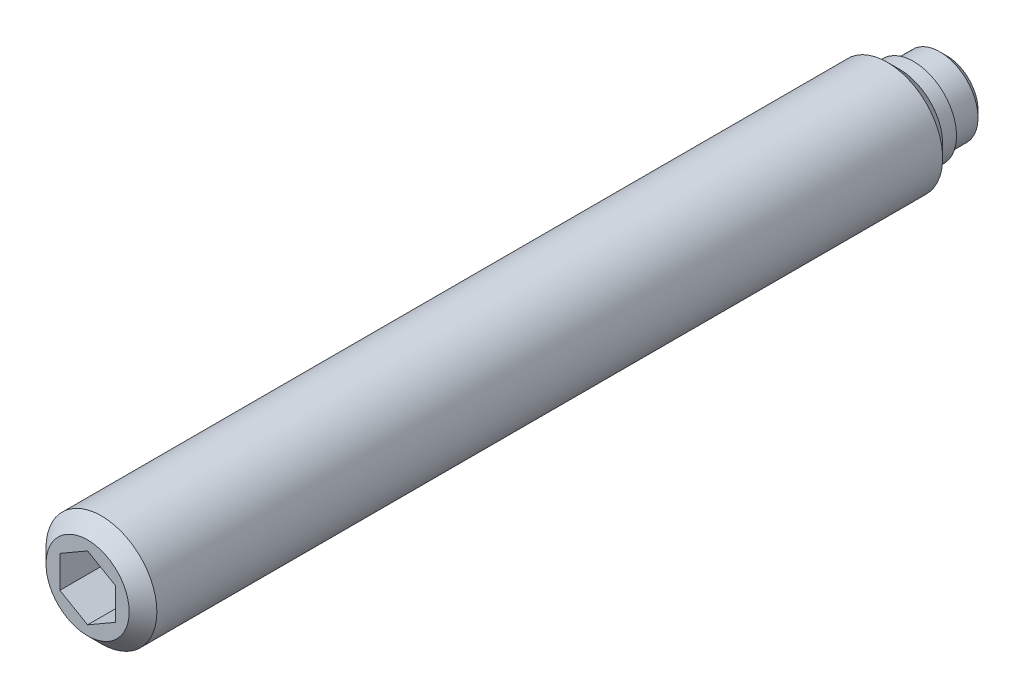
ISO-10303-21;
HEADER;
FILE_DESCRIPTION(('STEP AP214'),'2;1');
FILE_NAME('part.step','',(''),(''),'','','');
FILE_SCHEMA(('AUTOMOTIVE_DESIGN { 1 0 10303 214 1 1 1 1 }'));
ENDSEC;
DATA;
#1=APPLICATION_CONTEXT('core data for automotive mechanical design processes');
#2=APPLICATION_PROTOCOL_DEFINITION('international standard','automotive_design',2000,#1);
#3=PRODUCT_CONTEXT('',#1,'mechanical');
#4=PRODUCT('Part','Part','',(#3));
#5=PRODUCT_RELATED_PRODUCT_CATEGORY('part','',(#4));
#6=PRODUCT_DEFINITION_FORMATION('','',#4);
#7=PRODUCT_DEFINITION_CONTEXT('part definition',#1,'design');
#8=PRODUCT_DEFINITION('design','',#6,#7);
#9=PRODUCT_DEFINITION_SHAPE('','',#8);
#10=(LENGTH_UNIT() NAMED_UNIT(*) SI_UNIT(.MILLI.,.METRE.));
#11=(NAMED_UNIT(*) PLANE_ANGLE_UNIT() SI_UNIT($,.RADIAN.));
#12=(NAMED_UNIT(*) SI_UNIT($,.STERADIAN.) SOLID_ANGLE_UNIT());
#13=UNCERTAINTY_MEASURE_WITH_UNIT(LENGTH_MEASURE(1.E-05),#10,'distance_accuracy_value','');
#14=(GEOMETRIC_REPRESENTATION_CONTEXT(3) GLOBAL_UNCERTAINTY_ASSIGNED_CONTEXT((#13)) GLOBAL_UNIT_ASSIGNED_CONTEXT((#10,
#11,#12)) REPRESENTATION_CONTEXT('',''));
#15=CARTESIAN_POINT('',(0.,0.,0.));
#16=DIRECTION('',(0.,0.,1.));
#17=DIRECTION('',(1.,0.,0.));
#18=AXIS2_PLACEMENT_3D('',#15,#16,#17);
#19=CARTESIAN_POINT('',(0.,0.,2.4));
#20=DIRECTION('',(0.,0.,-1.));
#21=DIRECTION('',(-1.,0.,0.));
#22=AXIS2_PLACEMENT_3D('',#19,#20,#21);
#23=CYLINDRICAL_SURFACE('',#22,4.);
#24=CARTESIAN_POINT('',(0.,0.,4.3));
#25=DIRECTION('',(0.,0.,-1.));
#26=DIRECTION('',(-1.,0.,0.));
#27=AXIS2_PLACEMENT_3D('',#24,#25,#26);
#28=CIRCLE('',#27,4.);
#29=CARTESIAN_POINT('',(-4.,0.,4.3));
#30=VERTEX_POINT('',#29);
#31=EDGE_CURVE('E9',#30,#30,#28,.T.);
#32=ORIENTED_EDGE('',*,*,#31,.F.);
#33=EDGE_LOOP('',(#32));
#34=FACE_BOUND('',#33,.T.);
#35=CARTESIAN_POINT('',(0.,0.,61.));
#36=DIRECTION('',(0.,0.,1.));
#37=DIRECTION('',(1.,0.,0.));
#38=AXIS2_PLACEMENT_3D('',#35,#36,#37);
#39=CIRCLE('',#38,4.);
#40=CARTESIAN_POINT('',(4.,0.,61.));
#41=VERTEX_POINT('',#40);
#42=EDGE_CURVE('E70',#41,#41,#39,.T.);
#43=ORIENTED_EDGE('',*,*,#42,.F.);
#44=EDGE_LOOP('',(#43));
#45=FACE_BOUND('',#44,.T.);
#46=ADVANCED_FACE('F14',(#34,#45),#23,.T.);
#47=CARTESIAN_POINT('',(0.,0.,4.3));
#48=DIRECTION('',(0.,0.,1.));
#49=DIRECTION('',(1.,0.,0.));
#50=AXIS2_PLACEMENT_3D('',#47,#48,#49);
#51=CONICAL_SURFACE('',#50,4.,0.785398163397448);
#52=ORIENTED_EDGE('',*,*,#31,.T.);
#53=EDGE_LOOP('',(#52));
#54=FACE_BOUND('',#53,.T.);
#55=CARTESIAN_POINT('',(0.,0.,3.4));
#56=DIRECTION('',(0.,0.,-1.));
#57=DIRECTION('',(-1.,0.,0.));
#58=AXIS2_PLACEMENT_3D('',#55,#56,#57);
#59=CIRCLE('',#58,3.1);
#60=CARTESIAN_POINT('',(-3.1,0.,3.4));
#61=VERTEX_POINT('',#60);
#62=EDGE_CURVE('E21',#61,#61,#59,.T.);
#63=ORIENTED_EDGE('',*,*,#62,.F.);
#64=EDGE_LOOP('',(#63));
#65=FACE_BOUND('',#64,.T.);
#66=ADVANCED_FACE('F139',(#54,#65),#51,.T.);
#67=CARTESIAN_POINT('',(0.,0.,2.4));
#68=DIRECTION('',(0.,0.,-1.));
#69=DIRECTION('',(-1.,0.,0.));
#70=AXIS2_PLACEMENT_3D('',#67,#68,#69);
#71=CYLINDRICAL_SURFACE('',#70,3.1);
#72=ORIENTED_EDGE('',*,*,#62,.T.);
#73=EDGE_LOOP('',(#72));
#74=FACE_BOUND('',#73,.T.);
#75=CARTESIAN_POINT('',(0.,0.,2.4));
#76=DIRECTION('',(0.,0.,-1.));
#77=DIRECTION('',(-1.,0.,0.));
#78=AXIS2_PLACEMENT_3D('',#75,#76,#77);
#79=CIRCLE('',#78,3.1);
#80=CARTESIAN_POINT('',(-3.1,0.,2.4));
#81=VERTEX_POINT('',#80);
#82=EDGE_CURVE('E131',#81,#81,#79,.T.);
#83=ORIENTED_EDGE('',*,*,#82,.F.);
#84=EDGE_LOOP('',(#83));
#85=FACE_BOUND('',#84,.T.);
#86=ADVANCED_FACE('F136',(#74,#85),#71,.T.);
#87=CARTESIAN_POINT('',(0.,3.1,2.4));
#88=DIRECTION('',(0.,0.,1.));
#89=DIRECTION('',(1.,0.,0.));
#90=AXIS2_PLACEMENT_3D('',#87,#88,#89);
#91=PLANE('',#90);
#92=ORIENTED_EDGE('',*,*,#82,.T.);
#93=EDGE_LOOP('',(#92));
#94=FACE_BOUND('',#93,.T.);
#95=CARTESIAN_POINT('',(0.,0.,2.4));
#96=DIRECTION('',(0.,0.,-1.));
#97=DIRECTION('',(-1.,0.,0.));
#98=AXIS2_PLACEMENT_3D('',#95,#96,#97);
#99=CIRCLE('',#98,2.75);
#100=CARTESIAN_POINT('',(-2.75,0.,2.4));
#101=VERTEX_POINT('',#100);
#102=EDGE_CURVE('E128',#101,#101,#99,.T.);
#103=ORIENTED_EDGE('',*,*,#102,.F.);
#104=EDGE_LOOP('',(#103));
#105=FACE_BOUND('',#104,.T.);
#106=ADVANCED_FACE('F147',(#94,#105),#91,.F.);
#107=CARTESIAN_POINT('',(0.,0.,0.));
#108=DIRECTION('',(0.,0.,-1.));
#109=DIRECTION('',(-1.,0.,0.));
#110=AXIS2_PLACEMENT_3D('',#107,#108,#109);
#111=CYLINDRICAL_SURFACE('',#110,2.75);
#112=CARTESIAN_POINT('',(0.,0.,0.5));
#113=DIRECTION('',(0.,0.,-1.));
#114=DIRECTION('',(-1.,0.,0.));
#115=AXIS2_PLACEMENT_3D('',#112,#113,#114);
#116=CIRCLE('',#115,2.75);
#117=CARTESIAN_POINT('',(-2.75,0.,0.5));
#118=VERTEX_POINT('',#117);
#119=EDGE_CURVE('E125',#118,#118,#116,.T.);
#120=ORIENTED_EDGE('',*,*,#119,.F.);
#121=EDGE_LOOP('',(#120));
#122=FACE_BOUND('',#121,.T.);
#123=ORIENTED_EDGE('',*,*,#102,.T.);
#124=EDGE_LOOP('',(#123));
#125=FACE_BOUND('',#124,.T.);
#126=ADVANCED_FACE('F153',(#122,#125),#111,.T.);
#127=CARTESIAN_POINT('',(0.,0.,0.5));
#128=DIRECTION('',(0.,0.,1.));
#129=DIRECTION('',(1.,0.,0.));
#130=AXIS2_PLACEMENT_3D('',#127,#128,#129);
#131=CONICAL_SURFACE('',#130,2.75,0.785398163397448);
#132=CARTESIAN_POINT('',(0.,0.,0.));
#133=DIRECTION('',(0.,0.,-1.));
#134=DIRECTION('',(-1.,0.,0.));
#135=AXIS2_PLACEMENT_3D('',#132,#133,#134);
#136=CIRCLE('',#135,2.25);
#137=CARTESIAN_POINT('',(-2.25,0.,0.));
#138=VERTEX_POINT('',#137);
#139=EDGE_CURVE('E122',#138,#138,#136,.T.);
#140=ORIENTED_EDGE('',*,*,#139,.F.);
#141=EDGE_LOOP('',(#140));
#142=FACE_BOUND('',#141,.T.);
#143=ORIENTED_EDGE('',*,*,#119,.T.);
#144=EDGE_LOOP('',(#143));
#145=FACE_BOUND('',#144,.T.);
#146=ADVANCED_FACE('F157',(#142,#145),#131,.T.);
#147=CARTESIAN_POINT('',(0.,2.25,0.));
#148=DIRECTION('',(0.,0.,1.));
#149=DIRECTION('',(1.,0.,0.));
#150=AXIS2_PLACEMENT_3D('',#147,#148,#149);
#151=PLANE('',#150);
#152=ORIENTED_EDGE('',*,*,#139,.T.);
#153=EDGE_LOOP('',(#152));
#154=FACE_BOUND('',#153,.T.);
#155=ADVANCED_FACE('F161',(#154),#151,.F.);
#156=CARTESIAN_POINT('',(0.,0.,62.));
#157=DIRECTION('',(0.,0.,1.));
#158=DIRECTION('',(1.,0.,0.));
#159=AXIS2_PLACEMENT_3D('',#156,#157,#158);
#160=PLANE('',#159);
#161=DIRECTION('',(0.866025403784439,-0.5,0.));
#162=VECTOR('',#161,1.);
#163=CARTESIAN_POINT('',(-2.,-1.15470053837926,62.));
#164=LINE('',#163,#162);
#165=CARTESIAN_POINT('',(-2.,-1.15470053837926,62.));
#166=VERTEX_POINT('',#165);
#167=CARTESIAN_POINT('',(0.,-2.30940107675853,62.));
#168=VERTEX_POINT('',#167);
#169=EDGE_CURVE('E28',#166,#168,#164,.T.);
#170=ORIENTED_EDGE('',*,*,#169,.F.);
#171=DIRECTION('',(0.,-1.,0.));
#172=VECTOR('',#171,1.);
#173=CARTESIAN_POINT('',(-2.,1.15470053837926,62.));
#174=LINE('',#173,#172);
#175=CARTESIAN_POINT('',(-2.,1.15470053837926,62.));
#176=VERTEX_POINT('',#175);
#177=EDGE_CURVE('E69',#176,#166,#174,.T.);
#178=ORIENTED_EDGE('',*,*,#177,.F.);
#179=DIRECTION('',(-0.866025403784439,-0.5,0.));
#180=VECTOR('',#179,1.);
#181=CARTESIAN_POINT('',(0.,2.30940107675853,62.));
#182=LINE('',#181,#180);
#183=CARTESIAN_POINT('',(0.,2.30940107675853,62.));
#184=VERTEX_POINT('',#183);
#185=EDGE_CURVE('E105',#184,#176,#182,.T.);
#186=ORIENTED_EDGE('',*,*,#185,.F.);
#187=DIRECTION('',(-0.866025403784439,0.5,0.));
#188=VECTOR('',#187,1.);
#189=CARTESIAN_POINT('',(2.,1.15470053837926,62.));
#190=LINE('',#189,#188);
#191=CARTESIAN_POINT('',(2.,1.15470053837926,62.));
#192=VERTEX_POINT('',#191);
#193=EDGE_CURVE('E102',#192,#184,#190,.T.);
#194=ORIENTED_EDGE('',*,*,#193,.F.);
#195=DIRECTION('',(0.,1.,0.));
#196=VECTOR('',#195,1.);
#197=CARTESIAN_POINT('',(2.,-1.15470053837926,62.));
#198=LINE('',#197,#196);
#199=CARTESIAN_POINT('',(2.,-1.15470053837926,62.));
#200=VERTEX_POINT('',#199);
#201=EDGE_CURVE('E99',#200,#192,#198,.T.);
#202=ORIENTED_EDGE('',*,*,#201,.F.);
#203=DIRECTION('',(0.866025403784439,0.5,0.));
#204=VECTOR('',#203,1.);
#205=CARTESIAN_POINT('',(0.,-2.30940107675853,62.));
#206=LINE('',#205,#204);
#207=EDGE_CURVE('E96',#168,#200,#206,.T.);
#208=ORIENTED_EDGE('',*,*,#207,.F.);
#209=EDGE_LOOP('',(#170,#178,#186,#194,#202,#208));
#210=FACE_BOUND('',#209,.T.);
#211=CARTESIAN_POINT('',(0.,0.,62.));
#212=DIRECTION('',(0.,0.,1.));
#213=DIRECTION('',(1.,0.,0.));
#214=AXIS2_PLACEMENT_3D('',#211,#212,#213);
#215=CIRCLE('',#214,3.);
#216=CARTESIAN_POINT('',(3.,0.,62.));
#217=VERTEX_POINT('',#216);
#218=EDGE_CURVE('E119',#217,#217,#215,.T.);
#219=ORIENTED_EDGE('',*,*,#218,.T.);
#220=EDGE_LOOP('',(#219));
#221=FACE_BOUND('',#220,.T.);
#222=ADVANCED_FACE('F165',(#210,#221),#160,.T.);
#223=CARTESIAN_POINT('',(0.,0.,62.));
#224=DIRECTION('',(0.,0.,-1.));
#225=DIRECTION('',(-1.,0.,0.));
#226=AXIS2_PLACEMENT_3D('',#223,#224,#225);
#227=CONICAL_SURFACE('',#226,3.,0.785398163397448);
#228=ORIENTED_EDGE('',*,*,#42,.T.);
#229=EDGE_LOOP('',(#228));
#230=FACE_BOUND('',#229,.T.);
#231=ORIENTED_EDGE('',*,*,#218,.F.);
#232=EDGE_LOOP('',(#231));
#233=FACE_BOUND('',#232,.T.);
#234=ADVANCED_FACE('F169',(#230,#233),#227,.T.);
#235=CARTESIAN_POINT('',(-2.,-1.15470053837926,59.));
#236=DIRECTION('',(-0.5,-0.866025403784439,0.));
#237=DIRECTION('',(0.866025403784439,-0.5,0.));
#238=AXIS2_PLACEMENT_3D('',#235,#236,#237);
#239=PLANE('',#238);
#240=ORIENTED_EDGE('',*,*,#169,.T.);
#241=DIRECTION('',(0.,0.,1.));
#242=VECTOR('',#241,1.);
#243=CARTESIAN_POINT('',(0.,-2.30940107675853,59.));
#244=LINE('',#243,#242);
#245=CARTESIAN_POINT('',(0.,-2.30940107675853,57.));
#246=VERTEX_POINT('',#245);
#247=EDGE_CURVE('E76',#246,#168,#244,.T.);
#248=ORIENTED_EDGE('',*,*,#247,.F.);
#249=DIRECTION('',(0.866025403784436,-0.5,0.));
#250=VECTOR('',#249,1.);
#251=CARTESIAN_POINT('',(-2.,-1.15470053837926,57.));
#252=LINE('',#251,#250);
#253=CARTESIAN_POINT('',(-2.,-1.15470053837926,57.));
#254=VERTEX_POINT('',#253);
#255=EDGE_CURVE('E74',#254,#246,#252,.T.);
#256=ORIENTED_EDGE('',*,*,#255,.F.);
#257=DIRECTION('',(0.,0.,1.));
#258=VECTOR('',#257,1.);
#259=CARTESIAN_POINT('',(-2.,-1.15470053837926,59.));
#260=LINE('',#259,#258);
#261=EDGE_CURVE('E33',#254,#166,#260,.T.);
#262=ORIENTED_EDGE('',*,*,#261,.T.);
#263=EDGE_LOOP('',(#240,#248,#256,#262));
#264=FACE_BOUND('',#263,.T.);
#265=ADVANCED_FACE('F75',(#264),#239,.F.);
#266=CARTESIAN_POINT('',(-2.,1.15470053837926,59.));
#267=DIRECTION('',(-1.,0.,0.));
#268=DIRECTION('',(0.,0.,1.));
#269=AXIS2_PLACEMENT_3D('',#266,#267,#268);
#270=PLANE('',#269);
#271=ORIENTED_EDGE('',*,*,#177,.T.);
#272=ORIENTED_EDGE('',*,*,#261,.F.);
#273=DIRECTION('',(0.,-1.,0.));
#274=VECTOR('',#273,1.);
#275=CARTESIAN_POINT('',(-2.,1.15470053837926,57.));
#276=LINE('',#275,#274);
#277=CARTESIAN_POINT('',(-2.,1.15470053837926,57.));
#278=VERTEX_POINT('',#277);
#279=EDGE_CURVE('E66',#278,#254,#276,.T.);
#280=ORIENTED_EDGE('',*,*,#279,.F.);
#281=DIRECTION('',(0.,0.,1.));
#282=VECTOR('',#281,1.);
#283=CARTESIAN_POINT('',(-2.,1.15470053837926,59.));
#284=LINE('',#283,#282);
#285=EDGE_CURVE('E71',#278,#176,#284,.T.);
#286=ORIENTED_EDGE('',*,*,#285,.T.);
#287=EDGE_LOOP('',(#271,#272,#280,#286));
#288=FACE_BOUND('',#287,.T.);
#289=ADVANCED_FACE('F64',(#288),#270,.F.);
#290=CARTESIAN_POINT('',(0.,2.30940107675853,59.));
#291=DIRECTION('',(-0.5,0.866025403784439,0.));
#292=DIRECTION('',(-0.866025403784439,-0.5,0.));
#293=AXIS2_PLACEMENT_3D('',#290,#291,#292);
#294=PLANE('',#293);
#295=ORIENTED_EDGE('',*,*,#185,.T.);
#296=ORIENTED_EDGE('',*,*,#285,.F.);
#297=DIRECTION('',(-0.866025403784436,-0.5,0.));
#298=VECTOR('',#297,1.);
#299=CARTESIAN_POINT('',(0.,2.30940107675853,57.));
#300=LINE('',#299,#298);
#301=CARTESIAN_POINT('',(0.,2.30940107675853,57.));
#302=VERTEX_POINT('',#301);
#303=EDGE_CURVE('E85',#302,#278,#300,.T.);
#304=ORIENTED_EDGE('',*,*,#303,.F.);
#305=DIRECTION('',(0.,0.,1.));
#306=VECTOR('',#305,1.);
#307=CARTESIAN_POINT('',(0.,2.30940107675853,59.));
#308=LINE('',#307,#306);
#309=EDGE_CURVE('E110',#302,#184,#308,.T.);
#310=ORIENTED_EDGE('',*,*,#309,.T.);
#311=EDGE_LOOP('',(#295,#296,#304,#310));
#312=FACE_BOUND('',#311,.T.);
#313=ADVANCED_FACE('F187',(#312),#294,.F.);
#314=CARTESIAN_POINT('',(2.,1.15470053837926,59.));
#315=DIRECTION('',(0.5,0.866025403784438,0.));
#316=DIRECTION('',(-0.866025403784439,0.5,0.));
#317=AXIS2_PLACEMENT_3D('',#314,#315,#316);
#318=PLANE('',#317);
#319=ORIENTED_EDGE('',*,*,#193,.T.);
#320=ORIENTED_EDGE('',*,*,#309,.F.);
#321=DIRECTION('',(-0.866025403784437,0.5,0.));
#322=VECTOR('',#321,1.);
#323=CARTESIAN_POINT('',(2.,1.15470053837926,57.));
#324=LINE('',#323,#322);
#325=CARTESIAN_POINT('',(2.,1.15470053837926,57.));
#326=VERTEX_POINT('',#325);
#327=EDGE_CURVE('E92',#326,#302,#324,.T.);
#328=ORIENTED_EDGE('',*,*,#327,.F.);
#329=DIRECTION('',(0.,0.,1.));
#330=VECTOR('',#329,1.);
#331=CARTESIAN_POINT('',(2.,1.15470053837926,59.));
#332=LINE('',#331,#330);
#333=EDGE_CURVE('E112',#326,#192,#332,.T.);
#334=ORIENTED_EDGE('',*,*,#333,.T.);
#335=EDGE_LOOP('',(#319,#320,#328,#334));
#336=FACE_BOUND('',#335,.T.);
#337=ADVANCED_FACE('F183',(#336),#318,.F.);
#338=CARTESIAN_POINT('',(2.,-1.15470053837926,59.));
#339=DIRECTION('',(1.,0.,0.));
#340=DIRECTION('',(0.,0.,-1.));
#341=AXIS2_PLACEMENT_3D('',#338,#339,#340);
#342=PLANE('',#341);
#343=ORIENTED_EDGE('',*,*,#201,.T.);
#344=ORIENTED_EDGE('',*,*,#333,.F.);
#345=DIRECTION('',(0.,1.,0.));
#346=VECTOR('',#345,1.);
#347=CARTESIAN_POINT('',(2.,-1.15470053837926,57.));
#348=LINE('',#347,#346);
#349=CARTESIAN_POINT('',(2.,-1.15470053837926,57.));
#350=VERTEX_POINT('',#349);
#351=EDGE_CURVE('E89',#350,#326,#348,.T.);
#352=ORIENTED_EDGE('',*,*,#351,.F.);
#353=DIRECTION('',(0.,0.,1.));
#354=VECTOR('',#353,1.);
#355=CARTESIAN_POINT('',(2.,-1.15470053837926,59.));
#356=LINE('',#355,#354);
#357=EDGE_CURVE('E114',#350,#200,#356,.T.);
#358=ORIENTED_EDGE('',*,*,#357,.T.);
#359=EDGE_LOOP('',(#343,#344,#352,#358));
#360=FACE_BOUND('',#359,.T.);
#361=ADVANCED_FACE('F179',(#360),#342,.F.);
#362=CARTESIAN_POINT('',(0.,-2.30940107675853,59.));
#363=DIRECTION('',(0.5,-0.866025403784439,0.));
#364=DIRECTION('',(0.866025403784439,0.5,0.));
#365=AXIS2_PLACEMENT_3D('',#362,#363,#364);
#366=PLANE('',#365);
#367=ORIENTED_EDGE('',*,*,#207,.T.);
#368=ORIENTED_EDGE('',*,*,#357,.F.);
#369=DIRECTION('',(0.866025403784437,0.5,0.));
#370=VECTOR('',#369,1.);
#371=CARTESIAN_POINT('',(0.,-2.30940107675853,57.));
#372=LINE('',#371,#370);
#373=EDGE_CURVE('E80',#246,#350,#372,.T.);
#374=ORIENTED_EDGE('',*,*,#373,.F.);
#375=ORIENTED_EDGE('',*,*,#247,.T.);
#376=EDGE_LOOP('',(#367,#368,#374,#375));
#377=FACE_BOUND('',#376,.T.);
#378=ADVANCED_FACE('F176',(#377),#366,.F.);
#379=CARTESIAN_POINT('',(0.,0.,57.));
#380=DIRECTION('',(0.,0.,1.));
#381=DIRECTION('',(1.,0.,0.));
#382=AXIS2_PLACEMENT_3D('',#379,#380,#381);
#383=PLANE('',#382);
#384=ORIENTED_EDGE('',*,*,#279,.T.);
#385=ORIENTED_EDGE('',*,*,#255,.T.);
#386=ORIENTED_EDGE('',*,*,#373,.T.);
#387=ORIENTED_EDGE('',*,*,#351,.T.);
#388=ORIENTED_EDGE('',*,*,#327,.T.);
#389=ORIENTED_EDGE('',*,*,#303,.T.);
#390=EDGE_LOOP('',(#384,#385,#386,#387,#388,#389));
#391=FACE_BOUND('',#390,.T.);
#392=ADVANCED_FACE('F82',(#391),#383,.T.);
#393=CLOSED_SHELL('',(#46,#66,#86,#106,#126,#146,#155,#222,#234,#265,#289,#313,#337,#361,#378,#392));
#394=MANIFOLD_SOLID_BREP('B1',#393);
#395=ADVANCED_BREP_SHAPE_REPRESENTATION('',(#18,#394),#14);
#396=SHAPE_DEFINITION_REPRESENTATION(#9,#395);
ENDSEC;
END-ISO-10303-21;
